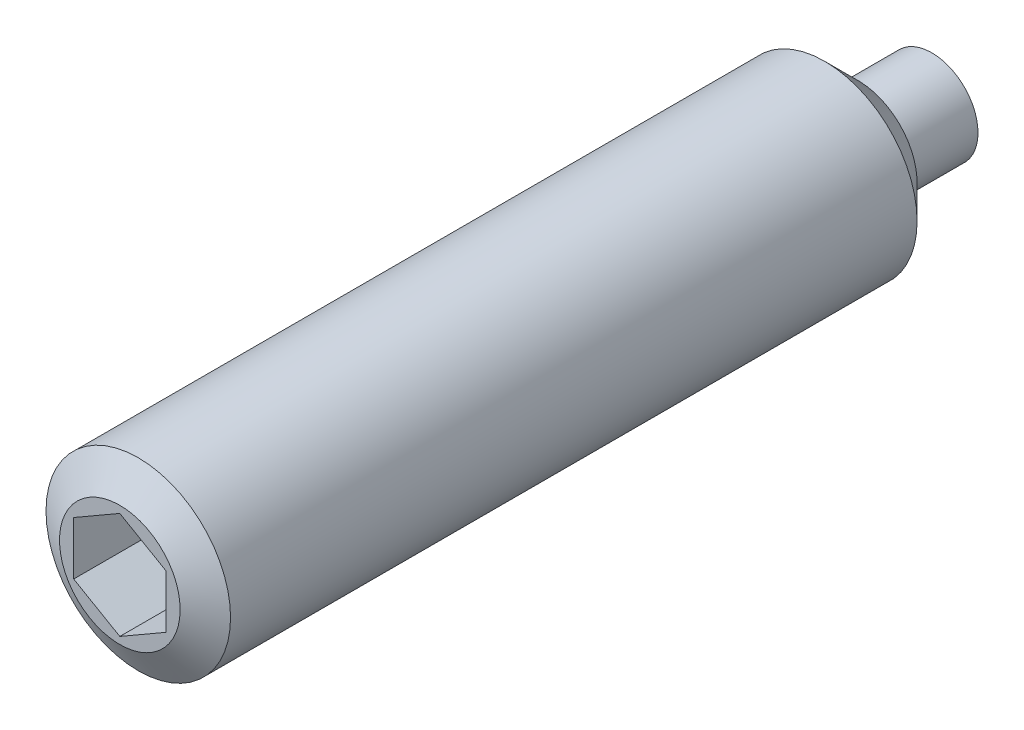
ISO-10303-21;
HEADER;
FILE_DESCRIPTION(('STEP AP214'),'2;1');
FILE_NAME('part.step','',(''),(''),'','','');
FILE_SCHEMA(('AUTOMOTIVE_DESIGN { 1 0 10303 214 1 1 1 1 }'));
ENDSEC;
DATA;
#1=APPLICATION_CONTEXT('core data for automotive mechanical design processes');
#2=APPLICATION_PROTOCOL_DEFINITION('international standard','automotive_design',2000,#1);
#3=PRODUCT_CONTEXT('',#1,'mechanical');
#4=PRODUCT('Part','Part','',(#3));
#5=PRODUCT_RELATED_PRODUCT_CATEGORY('part','',(#4));
#6=PRODUCT_DEFINITION_FORMATION('','',#4);
#7=PRODUCT_DEFINITION_CONTEXT('part definition',#1,'design');
#8=PRODUCT_DEFINITION('design','',#6,#7);
#9=PRODUCT_DEFINITION_SHAPE('','',#8);
#10=(LENGTH_UNIT() NAMED_UNIT(*) SI_UNIT(.MILLI.,.METRE.));
#11=(NAMED_UNIT(*) PLANE_ANGLE_UNIT() SI_UNIT($,.RADIAN.));
#12=(NAMED_UNIT(*) SI_UNIT($,.STERADIAN.) SOLID_ANGLE_UNIT());
#13=UNCERTAINTY_MEASURE_WITH_UNIT(LENGTH_MEASURE(1.E-05),#10,'distance_accuracy_value','');
#14=(GEOMETRIC_REPRESENTATION_CONTEXT(3) GLOBAL_UNCERTAINTY_ASSIGNED_CONTEXT((#13)) GLOBAL_UNIT_ASSIGNED_CONTEXT((#10,
#11,#12)) REPRESENTATION_CONTEXT('',''));
#15=CARTESIAN_POINT('',(0.,0.,0.));
#16=DIRECTION('',(0.,0.,1.));
#17=DIRECTION('',(1.,0.,0.));
#18=AXIS2_PLACEMENT_3D('',#15,#16,#17);
#19=CARTESIAN_POINT('',(1.25,0.,0.));
#20=DIRECTION('',(0.,0.,-1.));
#21=DIRECTION('',(-1.,0.,0.));
#22=AXIS2_PLACEMENT_3D('',#19,#20,#21);
#23=PLANE('',#22);
#24=CARTESIAN_POINT('',(0.,0.,0.));
#25=DIRECTION('',(0.,0.,1.));
#26=DIRECTION('',(1.,0.,0.));
#27=AXIS2_PLACEMENT_3D('',#24,#25,#26);
#28=CIRCLE('',#27,1.25);
#29=CARTESIAN_POINT('',(1.25,0.,0.));
#30=VERTEX_POINT('',#29);
#31=EDGE_CURVE('E124',#30,#30,#28,.T.);
#32=ORIENTED_EDGE('',*,*,#31,.F.);
#33=EDGE_LOOP('',(#32));
#34=FACE_BOUND('',#33,.T.);
#35=ADVANCED_FACE('F14',(#34),#23,.T.);
#36=CARTESIAN_POINT('',(0.,0.,42.));
#37=DIRECTION('',(0.,0.,1.));
#38=DIRECTION('',(1.,0.,0.));
#39=AXIS2_PLACEMENT_3D('',#36,#37,#38);
#40=CYLINDRICAL_SURFACE('',#39,1.25);
#41=CARTESIAN_POINT('',(0.,0.,2.));
#42=DIRECTION('',(0.,0.,1.));
#43=DIRECTION('',(1.,0.,0.));
#44=AXIS2_PLACEMENT_3D('',#41,#42,#43);
#45=CIRCLE('',#44,1.25);
#46=CARTESIAN_POINT('',(1.25,0.,2.));
#47=VERTEX_POINT('',#46);
#48=EDGE_CURVE('E121',#47,#47,#45,.T.);
#49=ORIENTED_EDGE('',*,*,#48,.F.);
#50=EDGE_LOOP('',(#49));
#51=FACE_BOUND('',#50,.T.);
#52=ORIENTED_EDGE('',*,*,#31,.T.);
#53=EDGE_LOOP('',(#52));
#54=FACE_BOUND('',#53,.T.);
#55=ADVANCED_FACE('F147',(#51,#54),#40,.T.);
#56=CARTESIAN_POINT('',(2.5,0.,2.));
#57=DIRECTION('',(0.,0.,-1.));
#58=DIRECTION('',(-1.,0.,0.));
#59=AXIS2_PLACEMENT_3D('',#56,#57,#58);
#60=PLANE('',#59);
#61=CARTESIAN_POINT('',(0.,0.,2.));
#62=DIRECTION('',(0.,0.,-1.));
#63=DIRECTION('',(-1.,0.,0.));
#64=AXIS2_PLACEMENT_3D('',#61,#62,#63);
#65=CIRCLE('',#64,1.6);
#66=CARTESIAN_POINT('',(-1.6,0.,2.));
#67=VERTEX_POINT('',#66);
#68=EDGE_CURVE('E130',#67,#67,#65,.T.);
#69=ORIENTED_EDGE('',*,*,#68,.T.);
#70=EDGE_LOOP('',(#69));
#71=FACE_BOUND('',#70,.T.);
#72=ORIENTED_EDGE('',*,*,#48,.T.);
#73=EDGE_LOOP('',(#72));
#74=FACE_BOUND('',#73,.T.);
#75=ADVANCED_FACE('F153',(#71,#74),#60,.T.);
#76=CARTESIAN_POINT('',(0.,0.,42.));
#77=DIRECTION('',(0.,0.,1.));
#78=DIRECTION('',(1.,0.,0.));
#79=AXIS2_PLACEMENT_3D('',#76,#77,#78);
#80=CYLINDRICAL_SURFACE('',#79,2.5);
#81=CARTESIAN_POINT('',(0.,0.,21.5));
#82=DIRECTION('',(0.,0.,1.));
#83=DIRECTION('',(1.,0.,0.));
#84=AXIS2_PLACEMENT_3D('',#81,#82,#83);
#85=CIRCLE('',#84,2.5);
#86=CARTESIAN_POINT('',(2.5,0.,21.5));
#87=VERTEX_POINT('',#86);
#88=EDGE_CURVE('E9',#87,#87,#85,.F.);
#89=ORIENTED_EDGE('',*,*,#88,.T.);
#90=EDGE_LOOP('',(#89));
#91=FACE_BOUND('',#90,.T.);
#92=CARTESIAN_POINT('',(0.,0.,2.9));
#93=DIRECTION('',(0.,0.,-1.));
#94=DIRECTION('',(-1.,0.,0.));
#95=AXIS2_PLACEMENT_3D('',#92,#93,#94);
#96=CIRCLE('',#95,2.5);
#97=CARTESIAN_POINT('',(-2.5,0.,2.9));
#98=VERTEX_POINT('',#97);
#99=EDGE_CURVE('E127',#98,#98,#96,.F.);
#100=ORIENTED_EDGE('',*,*,#99,.T.);
#101=EDGE_LOOP('',(#100));
#102=FACE_BOUND('',#101,.T.);
#103=ADVANCED_FACE('F160',(#91,#102),#80,.T.);
#104=CARTESIAN_POINT('',(0.,0.,2.9));
#105=DIRECTION('',(0.,0.,1.));
#106=DIRECTION('',(1.,0.,0.));
#107=AXIS2_PLACEMENT_3D('',#104,#105,#106);
#108=CONICAL_SURFACE('',#107,2.5,0.785398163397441);
#109=ORIENTED_EDGE('',*,*,#68,.F.);
#110=EDGE_LOOP('',(#109));
#111=FACE_BOUND('',#110,.T.);
#112=ORIENTED_EDGE('',*,*,#99,.F.);
#113=EDGE_LOOP('',(#112));
#114=FACE_BOUND('',#113,.T.);
#115=ADVANCED_FACE('F163',(#111,#114),#108,.T.);
#116=CARTESIAN_POINT('',(1.25,-2.16506350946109,19.5));
#117=DIRECTION('',(0.,0.,-1.));
#118=DIRECTION('',(-1.,0.,0.));
#119=AXIS2_PLACEMENT_3D('',#116,#117,#118);
#120=PLANE('',#119);
#121=DIRECTION('',(0.86602540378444,-0.5,0.));
#122=VECTOR('',#121,1.);
#123=CARTESIAN_POINT('',(-1.25,-0.721687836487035,19.5));
#124=LINE('',#123,#122);
#125=CARTESIAN_POINT('',(-1.25,-0.721687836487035,19.5));
#126=VERTEX_POINT('',#125);
#127=CARTESIAN_POINT('',(0.,-1.44337567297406,19.5));
#128=VERTEX_POINT('',#127);
#129=EDGE_CURVE('E99',#126,#128,#124,.T.);
#130=ORIENTED_EDGE('',*,*,#129,.T.);
#131=DIRECTION('',(-0.866025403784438,-0.5,0.));
#132=VECTOR('',#131,1.);
#133=CARTESIAN_POINT('',(1.25,-0.721687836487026,19.5));
#134=LINE('',#133,#132);
#135=CARTESIAN_POINT('',(1.25,-0.721687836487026,19.5));
#136=VERTEX_POINT('',#135);
#137=EDGE_CURVE('E102',#136,#128,#134,.T.);
#138=ORIENTED_EDGE('',*,*,#137,.F.);
#139=DIRECTION('',(0.,-1.,0.));
#140=VECTOR('',#139,1.);
#141=CARTESIAN_POINT('',(1.25,0.721687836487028,19.5));
#142=LINE('',#141,#140);
#143=CARTESIAN_POINT('',(1.25,0.721687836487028,19.5));
#144=VERTEX_POINT('',#143);
#145=EDGE_CURVE('E75',#144,#136,#142,.T.);
#146=ORIENTED_EDGE('',*,*,#145,.F.);
#147=DIRECTION('',(-0.866025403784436,0.5,0.));
#148=VECTOR('',#147,1.);
#149=CARTESIAN_POINT('',(1.25,0.721687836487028,19.5));
#150=LINE('',#149,#148);
#151=CARTESIAN_POINT('',(0.,1.44337567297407,19.5));
#152=VERTEX_POINT('',#151);
#153=EDGE_CURVE('E105',#144,#152,#150,.T.);
#154=ORIENTED_EDGE('',*,*,#153,.T.);
#155=DIRECTION('',(0.866025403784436,0.5,0.));
#156=VECTOR('',#155,1.);
#157=CARTESIAN_POINT('',(-1.25,0.721687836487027,19.5));
#158=LINE('',#157,#156);
#159=CARTESIAN_POINT('',(-1.25,0.721687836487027,19.5));
#160=VERTEX_POINT('',#159);
#161=EDGE_CURVE('E108',#160,#152,#158,.T.);
#162=ORIENTED_EDGE('',*,*,#161,.F.);
#163=DIRECTION('',(0.,-1.,0.));
#164=VECTOR('',#163,1.);
#165=CARTESIAN_POINT('',(-1.25,0.721687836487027,19.5));
#166=LINE('',#165,#164);
#167=EDGE_CURVE('E111',#160,#126,#166,.T.);
#168=ORIENTED_EDGE('',*,*,#167,.T.);
#169=EDGE_LOOP('',(#130,#138,#146,#154,#162,#168));
#170=FACE_BOUND('',#169,.T.);
#171=ADVANCED_FACE('F181',(#170),#120,.F.);
#172=CARTESIAN_POINT('',(1.25,-0.721687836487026,19.5));
#173=DIRECTION('',(-0.5,0.866025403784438,0.));
#174=DIRECTION('',(0.866025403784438,0.5,0.));
#175=AXIS2_PLACEMENT_3D('',#172,#173,#174);
#176=PLANE('',#175);
#177=ORIENTED_EDGE('',*,*,#137,.T.);
#178=DIRECTION('',(0.,0.,1.));
#179=VECTOR('',#178,1.);
#180=CARTESIAN_POINT('',(0.,-1.44337567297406,19.5));
#181=LINE('',#180,#179);
#182=CARTESIAN_POINT('',(0.,-1.44337567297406,22.));
#183=VERTEX_POINT('',#182);
#184=EDGE_CURVE('E80',#128,#183,#181,.T.);
#185=ORIENTED_EDGE('',*,*,#184,.T.);
#186=DIRECTION('',(-0.866025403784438,-0.5,0.));
#187=VECTOR('',#186,1.);
#188=CARTESIAN_POINT('',(1.25,-0.721687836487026,22.));
#189=LINE('',#188,#187);
#190=CARTESIAN_POINT('',(1.25,-0.721687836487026,22.));
#191=VERTEX_POINT('',#190);
#192=EDGE_CURVE('E83',#191,#183,#189,.T.);
#193=ORIENTED_EDGE('',*,*,#192,.F.);
#194=DIRECTION('',(0.,0.,1.));
#195=VECTOR('',#194,1.);
#196=CARTESIAN_POINT('',(1.25,-0.721687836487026,19.5));
#197=LINE('',#196,#195);
#198=EDGE_CURVE('E68',#136,#191,#197,.T.);
#199=ORIENTED_EDGE('',*,*,#198,.F.);
#200=EDGE_LOOP('',(#177,#185,#193,#199));
#201=FACE_BOUND('',#200,.T.);
#202=ADVANCED_FACE('F84',(#201),#176,.T.);
#203=CARTESIAN_POINT('',(1.25,0.721687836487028,19.5));
#204=DIRECTION('',(-1.,0.,0.));
#205=DIRECTION('',(0.,1.,0.));
#206=AXIS2_PLACEMENT_3D('',#203,#204,#205);
#207=PLANE('',#206);
#208=ORIENTED_EDGE('',*,*,#198,.T.);
#209=DIRECTION('',(0.,-1.,0.));
#210=VECTOR('',#209,1.);
#211=CARTESIAN_POINT('',(1.25,0.721687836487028,22.));
#212=LINE('',#211,#210);
#213=CARTESIAN_POINT('',(1.25,0.721687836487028,22.));
#214=VERTEX_POINT('',#213);
#215=EDGE_CURVE('E72',#214,#191,#212,.T.);
#216=ORIENTED_EDGE('',*,*,#215,.F.);
#217=DIRECTION('',(0.,0.,1.));
#218=VECTOR('',#217,1.);
#219=CARTESIAN_POINT('',(1.25,0.721687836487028,19.5));
#220=LINE('',#219,#218);
#221=EDGE_CURVE('E79',#144,#214,#220,.T.);
#222=ORIENTED_EDGE('',*,*,#221,.F.);
#223=ORIENTED_EDGE('',*,*,#145,.T.);
#224=EDGE_LOOP('',(#208,#216,#222,#223));
#225=FACE_BOUND('',#224,.T.);
#226=ADVANCED_FACE('F70',(#225),#207,.T.);
#227=CARTESIAN_POINT('',(1.25,0.721687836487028,19.5));
#228=DIRECTION('',(0.5,0.866025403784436,0.));
#229=DIRECTION('',(0.866025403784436,-0.5,0.));
#230=AXIS2_PLACEMENT_3D('',#227,#228,#229);
#231=PLANE('',#230);
#232=ORIENTED_EDGE('',*,*,#221,.T.);
#233=DIRECTION('',(-0.866025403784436,0.5,0.));
#234=VECTOR('',#233,1.);
#235=CARTESIAN_POINT('',(1.25,0.721687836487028,22.));
#236=LINE('',#235,#234);
#237=CARTESIAN_POINT('',(0.,1.44337567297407,22.));
#238=VERTEX_POINT('',#237);
#239=EDGE_CURVE('E90',#214,#238,#236,.T.);
#240=ORIENTED_EDGE('',*,*,#239,.T.);
#241=DIRECTION('',(0.,0.,1.));
#242=VECTOR('',#241,1.);
#243=CARTESIAN_POINT('',(0.,1.44337567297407,19.5));
#244=LINE('',#243,#242);
#245=EDGE_CURVE('E116',#152,#238,#244,.T.);
#246=ORIENTED_EDGE('',*,*,#245,.F.);
#247=ORIENTED_EDGE('',*,*,#153,.F.);
#248=EDGE_LOOP('',(#232,#240,#246,#247));
#249=FACE_BOUND('',#248,.T.);
#250=ADVANCED_FACE('F172',(#249),#231,.F.);
#251=CARTESIAN_POINT('',(-1.25,0.721687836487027,19.5));
#252=DIRECTION('',(0.5,-0.866025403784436,0.));
#253=DIRECTION('',(-0.866025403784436,-0.5,0.));
#254=AXIS2_PLACEMENT_3D('',#251,#252,#253);
#255=PLANE('',#254);
#256=ORIENTED_EDGE('',*,*,#245,.T.);
#257=DIRECTION('',(0.866025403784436,0.5,0.));
#258=VECTOR('',#257,1.);
#259=CARTESIAN_POINT('',(-1.25,0.721687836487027,22.));
#260=LINE('',#259,#258);
#261=CARTESIAN_POINT('',(-1.25,0.721687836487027,22.));
#262=VERTEX_POINT('',#261);
#263=EDGE_CURVE('E92',#262,#238,#260,.T.);
#264=ORIENTED_EDGE('',*,*,#263,.F.);
#265=DIRECTION('',(0.,0.,1.));
#266=VECTOR('',#265,1.);
#267=CARTESIAN_POINT('',(-1.25,0.721687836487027,19.5));
#268=LINE('',#267,#266);
#269=EDGE_CURVE('E118',#160,#262,#268,.T.);
#270=ORIENTED_EDGE('',*,*,#269,.F.);
#271=ORIENTED_EDGE('',*,*,#161,.T.);
#272=EDGE_LOOP('',(#256,#264,#270,#271));
#273=FACE_BOUND('',#272,.T.);
#274=ADVANCED_FACE('F169',(#273),#255,.T.);
#275=CARTESIAN_POINT('',(-1.25,0.721687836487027,19.5));
#276=DIRECTION('',(-1.,0.,0.));
#277=DIRECTION('',(0.,1.,0.));
#278=AXIS2_PLACEMENT_3D('',#275,#276,#277);
#279=PLANE('',#278);
#280=ORIENTED_EDGE('',*,*,#269,.T.);
#281=DIRECTION('',(0.,-1.,0.));
#282=VECTOR('',#281,1.);
#283=CARTESIAN_POINT('',(-1.25,0.721687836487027,22.));
#284=LINE('',#283,#282);
#285=CARTESIAN_POINT('',(-1.25,-0.721687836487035,22.));
#286=VERTEX_POINT('',#285);
#287=EDGE_CURVE('E97',#262,#286,#284,.T.);
#288=ORIENTED_EDGE('',*,*,#287,.T.);
#289=DIRECTION('',(0.,0.,1.));
#290=VECTOR('',#289,1.);
#291=CARTESIAN_POINT('',(-1.25,-0.721687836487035,19.5));
#292=LINE('',#291,#290);
#293=EDGE_CURVE('E36',#126,#286,#292,.T.);
#294=ORIENTED_EDGE('',*,*,#293,.F.);
#295=ORIENTED_EDGE('',*,*,#167,.F.);
#296=EDGE_LOOP('',(#280,#288,#294,#295));
#297=FACE_BOUND('',#296,.T.);
#298=ADVANCED_FACE('F166',(#297),#279,.F.);
#299=CARTESIAN_POINT('',(-1.25,-0.721687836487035,19.5));
#300=DIRECTION('',(-0.5,-0.86602540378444,0.));
#301=DIRECTION('',(-0.86602540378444,0.5,0.));
#302=AXIS2_PLACEMENT_3D('',#299,#300,#301);
#303=PLANE('',#302);
#304=ORIENTED_EDGE('',*,*,#293,.T.);
#305=DIRECTION('',(0.86602540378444,-0.5,0.));
#306=VECTOR('',#305,1.);
#307=CARTESIAN_POINT('',(-1.25,-0.721687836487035,22.));
#308=LINE('',#307,#306);
#309=EDGE_CURVE('E29',#286,#183,#308,.T.);
#310=ORIENTED_EDGE('',*,*,#309,.T.);
#311=ORIENTED_EDGE('',*,*,#184,.F.);
#312=ORIENTED_EDGE('',*,*,#129,.F.);
#313=EDGE_LOOP('',(#304,#310,#311,#312));
#314=FACE_BOUND('',#313,.T.);
#315=ADVANCED_FACE('F143',(#314),#303,.F.);
#316=CARTESIAN_POINT('',(0.,0.,22.));
#317=DIRECTION('',(0.,0.,1.));
#318=DIRECTION('',(1.,0.,0.));
#319=AXIS2_PLACEMENT_3D('',#316,#317,#318);
#320=PLANE('',#319);
#321=CARTESIAN_POINT('',(0.,0.,22.));
#322=DIRECTION('',(0.,0.,1.));
#323=DIRECTION('',(1.,0.,0.));
#324=AXIS2_PLACEMENT_3D('',#321,#322,#323);
#325=CIRCLE('',#324,1.63397459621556);
#326=CARTESIAN_POINT('',(1.63397459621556,0.,22.));
#327=VERTEX_POINT('',#326);
#328=EDGE_CURVE('E22',#327,#327,#325,.T.);
#329=ORIENTED_EDGE('',*,*,#328,.T.);
#330=EDGE_LOOP('',(#329));
#331=FACE_BOUND('',#330,.T.);
#332=ORIENTED_EDGE('',*,*,#309,.F.);
#333=ORIENTED_EDGE('',*,*,#287,.F.);
#334=ORIENTED_EDGE('',*,*,#263,.T.);
#335=ORIENTED_EDGE('',*,*,#239,.F.);
#336=ORIENTED_EDGE('',*,*,#215,.T.);
#337=ORIENTED_EDGE('',*,*,#192,.T.);
#338=EDGE_LOOP('',(#332,#333,#334,#335,#336,#337));
#339=FACE_BOUND('',#338,.T.);
#340=ADVANCED_FACE('F87',(#331,#339),#320,.T.);
#341=CARTESIAN_POINT('',(0.,0.,22.));
#342=DIRECTION('',(0.,0.,-1.));
#343=DIRECTION('',(-1.,0.,0.));
#344=AXIS2_PLACEMENT_3D('',#341,#342,#343);
#345=CONICAL_SURFACE('',#344,1.63397459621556,1.0471975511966);
#346=ORIENTED_EDGE('',*,*,#88,.F.);
#347=EDGE_LOOP('',(#346));
#348=FACE_BOUND('',#347,.T.);
#349=ORIENTED_EDGE('',*,*,#328,.F.);
#350=EDGE_LOOP('',(#349));
#351=FACE_BOUND('',#350,.T.);
#352=ADVANCED_FACE('F16',(#348,#351),#345,.T.);
#353=CLOSED_SHELL('',(#35,#55,#75,#103,#115,#171,#202,#226,#250,#274,#298,#315,#340,#352));
#354=MANIFOLD_SOLID_BREP('B1',#353);
#355=ADVANCED_BREP_SHAPE_REPRESENTATION('',(#18,#354),#14);
#356=SHAPE_DEFINITION_REPRESENTATION(#9,#355);
ENDSEC;
END-ISO-10303-21;
